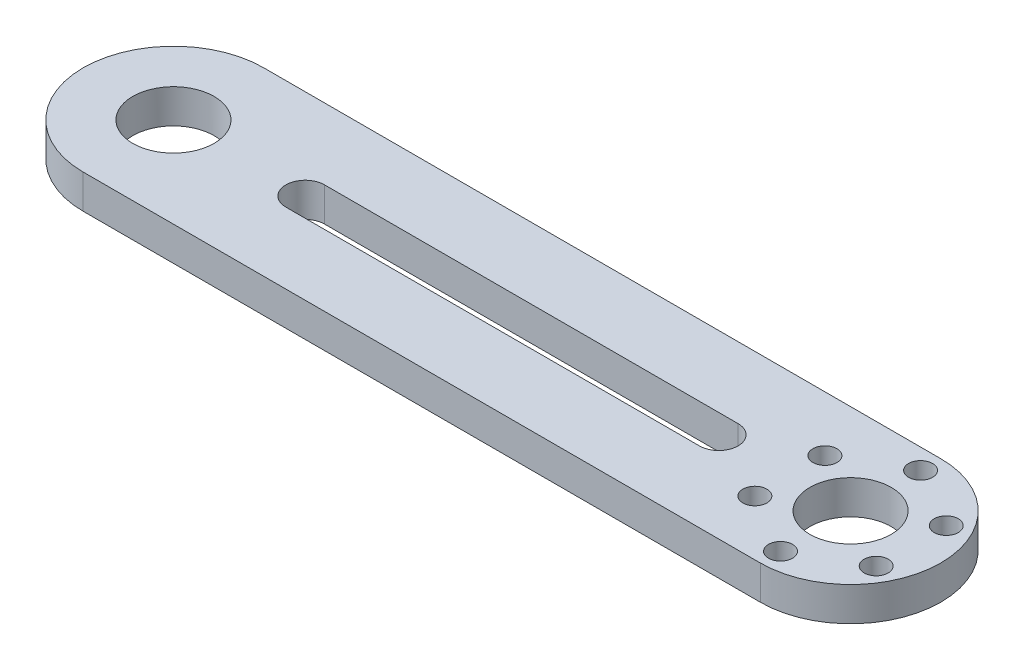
ISO-10303-21;
HEADER;
FILE_DESCRIPTION(('STEP AP214'),'2;1');
FILE_NAME('part.step','',(''),(''),'','','');
FILE_SCHEMA(('AUTOMOTIVE_DESIGN { 1 0 10303 214 1 1 1 1 }'));
ENDSEC;
DATA;
#1=APPLICATION_CONTEXT('core data for automotive mechanical design processes');
#2=APPLICATION_PROTOCOL_DEFINITION('international standard','automotive_design',2000,#1);
#3=PRODUCT_CONTEXT('',#1,'mechanical');
#4=PRODUCT('Part','Part','',(#3));
#5=PRODUCT_RELATED_PRODUCT_CATEGORY('part','',(#4));
#6=PRODUCT_DEFINITION_FORMATION('','',#4);
#7=PRODUCT_DEFINITION_CONTEXT('part definition',#1,'design');
#8=PRODUCT_DEFINITION('design','',#6,#7);
#9=PRODUCT_DEFINITION_SHAPE('','',#8);
#10=(LENGTH_UNIT() NAMED_UNIT(*) SI_UNIT(.MILLI.,.METRE.));
#11=(NAMED_UNIT(*) PLANE_ANGLE_UNIT() SI_UNIT($,.RADIAN.));
#12=(NAMED_UNIT(*) SI_UNIT($,.STERADIAN.) SOLID_ANGLE_UNIT());
#13=UNCERTAINTY_MEASURE_WITH_UNIT(LENGTH_MEASURE(1.E-05),#10,'distance_accuracy_value','');
#14=(GEOMETRIC_REPRESENTATION_CONTEXT(3) GLOBAL_UNCERTAINTY_ASSIGNED_CONTEXT((#13)) GLOBAL_UNIT_ASSIGNED_CONTEXT((#10,
#11,#12)) REPRESENTATION_CONTEXT('',''));
#15=CARTESIAN_POINT('',(0.,0.,0.));
#16=DIRECTION('',(0.,0.,1.));
#17=DIRECTION('',(1.,0.,0.));
#18=AXIS2_PLACEMENT_3D('',#15,#16,#17);
#19=CARTESIAN_POINT('',(51.,5.12,0.));
#20=DIRECTION('',(0.,1.,0.));
#21=DIRECTION('',(0.,0.,1.));
#22=AXIS2_PLACEMENT_3D('',#19,#20,#21);
#23=PLANE('',#22);
#24=CARTESIAN_POINT('',(-51.,5.12,0.));
#25=DIRECTION('',(0.,1.,0.));
#26=DIRECTION('',(0.,0.,-1.));
#27=AXIS2_PLACEMENT_3D('',#24,#25,#26);
#28=CIRCLE('',#27,6.13000000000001);
#29=CARTESIAN_POINT('',(-51.,5.12,-6.13000000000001));
#30=VERTEX_POINT('',#29);
#31=EDGE_CURVE('E383',#30,#30,#28,.T.);
#32=ORIENTED_EDGE('',*,*,#31,.F.);
#33=EDGE_LOOP('',(#32));
#34=FACE_BOUND('',#33,.T.);
#35=CARTESIAN_POINT('',(41.8634319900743,5.12,-5.27499999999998));
#36=DIRECTION('',(0.,1.,0.));
#37=DIRECTION('',(0.,0.,1.));
#38=AXIS2_PLACEMENT_3D('',#35,#36,#37);
#39=CIRCLE('',#38,1.81);
#40=CARTESIAN_POINT('',(41.8634319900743,5.12,-3.46499999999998));
#41=VERTEX_POINT('',#40);
#42=EDGE_CURVE('E393',#41,#41,#39,.T.);
#43=ORIENTED_EDGE('',*,*,#42,.F.);
#44=EDGE_LOOP('',(#43));
#45=FACE_BOUND('',#44,.T.);
#46=CARTESIAN_POINT('',(41.8634319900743,5.12,5.27500000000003));
#47=DIRECTION('',(0.,1.,0.));
#48=DIRECTION('',(0.,0.,1.));
#49=AXIS2_PLACEMENT_3D('',#46,#47,#48);
#50=CIRCLE('',#49,1.80999999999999);
#51=CARTESIAN_POINT('',(41.8634319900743,5.12,7.08500000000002));
#52=VERTEX_POINT('',#51);
#53=EDGE_CURVE('E436',#52,#52,#50,.T.);
#54=ORIENTED_EDGE('',*,*,#53,.F.);
#55=EDGE_LOOP('',(#54));
#56=FACE_BOUND('',#55,.T.);
#57=CARTESIAN_POINT('',(51.0000000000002,5.12,10.55));
#58=DIRECTION('',(0.,1.,0.));
#59=DIRECTION('',(0.,0.,1.));
#60=AXIS2_PLACEMENT_3D('',#57,#58,#59);
#61=CIRCLE('',#60,1.80999999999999);
#62=CARTESIAN_POINT('',(51.0000000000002,5.12,12.36));
#63=VERTEX_POINT('',#62);
#64=EDGE_CURVE('E428',#63,#63,#61,.T.);
#65=ORIENTED_EDGE('',*,*,#64,.F.);
#66=EDGE_LOOP('',(#65));
#67=FACE_BOUND('',#66,.T.);
#68=CARTESIAN_POINT('',(60.136568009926,5.12,5.27499999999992));
#69=DIRECTION('',(0.,1.,0.));
#70=DIRECTION('',(0.,0.,1.));
#71=AXIS2_PLACEMENT_3D('',#68,#69,#70);
#72=CIRCLE('',#71,1.81);
#73=CARTESIAN_POINT('',(60.136568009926,5.12,7.08499999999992));
#74=VERTEX_POINT('',#73);
#75=EDGE_CURVE('E420',#74,#74,#72,.T.);
#76=ORIENTED_EDGE('',*,*,#75,.F.);
#77=EDGE_LOOP('',(#76));
#78=FACE_BOUND('',#77,.T.);
#79=CARTESIAN_POINT('',(60.1365680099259,5.12,-5.27500000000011));
#80=DIRECTION('',(0.,1.,0.));
#81=DIRECTION('',(0.,0.,1.));
#82=AXIS2_PLACEMENT_3D('',#79,#80,#81);
#83=CIRCLE('',#82,1.80999999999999);
#84=CARTESIAN_POINT('',(60.1365680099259,5.12,-3.46500000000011));
#85=VERTEX_POINT('',#84);
#86=EDGE_CURVE('E412',#85,#85,#83,.T.);
#87=ORIENTED_EDGE('',*,*,#86,.F.);
#88=EDGE_LOOP('',(#87));
#89=FACE_BOUND('',#88,.T.);
#90=CARTESIAN_POINT('',(51.,5.12,-10.55));
#91=DIRECTION('',(0.,1.,0.));
#92=DIRECTION('',(0.,0.,1.));
#93=AXIS2_PLACEMENT_3D('',#90,#91,#92);
#94=CIRCLE('',#93,1.81);
#95=CARTESIAN_POINT('',(51.,5.12,-8.74));
#96=VERTEX_POINT('',#95);
#97=EDGE_CURVE('E399',#96,#96,#94,.T.);
#98=ORIENTED_EDGE('',*,*,#97,.F.);
#99=EDGE_LOOP('',(#98));
#100=FACE_BOUND('',#99,.T.);
#101=CARTESIAN_POINT('',(51.,5.12,0.));
#102=DIRECTION('',(0.,1.,0.));
#103=DIRECTION('',(0.,0.,1.));
#104=AXIS2_PLACEMENT_3D('',#101,#102,#103);
#105=CIRCLE('',#104,6.13000000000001);
#106=CARTESIAN_POINT('',(51.,5.12,6.13000000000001));
#107=VERTEX_POINT('',#106);
#108=EDGE_CURVE('E396',#107,#107,#105,.T.);
#109=ORIENTED_EDGE('',*,*,#108,.F.);
#110=EDGE_LOOP('',(#109));
#111=FACE_BOUND('',#110,.T.);
#112=CARTESIAN_POINT('',(51.,5.12,0.));
#113=DIRECTION('',(0.,1.,0.));
#114=DIRECTION('',(0.,0.,1.));
#115=AXIS2_PLACEMENT_3D('',#112,#113,#114);
#116=CIRCLE('',#115,13.6);
#117=CARTESIAN_POINT('',(51.,5.12,13.6));
#118=VERTEX_POINT('',#117);
#119=CARTESIAN_POINT('',(51.,5.12,-13.6));
#120=VERTEX_POINT('',#119);
#121=EDGE_CURVE('E184',#118,#120,#116,.T.);
#122=ORIENTED_EDGE('',*,*,#121,.T.);
#123=DIRECTION('',(-1.,0.,0.));
#124=VECTOR('',#123,1.);
#125=CARTESIAN_POINT('',(51.,5.12,-13.6));
#126=LINE('',#125,#124);
#127=CARTESIAN_POINT('',(-51.,5.12,-13.6));
#128=VERTEX_POINT('',#127);
#129=EDGE_CURVE('E188',#120,#128,#126,.T.);
#130=ORIENTED_EDGE('',*,*,#129,.T.);
#131=CARTESIAN_POINT('',(-51.,5.12,0.));
#132=DIRECTION('',(0.,1.,0.));
#133=DIRECTION('',(0.,0.,1.));
#134=AXIS2_PLACEMENT_3D('',#131,#132,#133);
#135=CIRCLE('',#134,13.6);
#136=CARTESIAN_POINT('',(-51.,5.12,13.6));
#137=VERTEX_POINT('',#136);
#138=EDGE_CURVE('E192',#128,#137,#135,.T.);
#139=ORIENTED_EDGE('',*,*,#138,.T.);
#140=DIRECTION('',(-1.,0.,0.));
#141=VECTOR('',#140,1.);
#142=CARTESIAN_POINT('',(51.,5.12,13.6));
#143=LINE('',#142,#141);
#144=EDGE_CURVE('E195',#118,#137,#143,.T.);
#145=ORIENTED_EDGE('',*,*,#144,.F.);
#146=EDGE_LOOP('',(#122,#130,#139,#145));
#147=FACE_BOUND('',#146,.T.);
#148=DIRECTION('',(-1.,0.,0.));
#149=VECTOR('',#148,1.);
#150=CARTESIAN_POINT('',(31.15,5.12,-2.91000000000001));
#151=LINE('',#150,#149);
#152=CARTESIAN_POINT('',(31.15,5.12,-2.91000000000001));
#153=VERTEX_POINT('',#152);
#154=CARTESIAN_POINT('',(-31.15,5.12,-2.90999999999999));
#155=VERTEX_POINT('',#154);
#156=EDGE_CURVE('E144',#153,#155,#151,.T.);
#157=ORIENTED_EDGE('',*,*,#156,.F.);
#158=CARTESIAN_POINT('',(31.15,5.12,0.));
#159=DIRECTION('',(0.,1.,0.));
#160=DIRECTION('',(0.,0.,1.));
#161=AXIS2_PLACEMENT_3D('',#158,#159,#160);
#162=CIRCLE('',#161,2.91);
#163=CARTESIAN_POINT('',(31.15,5.12,2.90999999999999));
#164=VERTEX_POINT('',#163);
#165=EDGE_CURVE('E135',#164,#153,#162,.T.);
#166=ORIENTED_EDGE('',*,*,#165,.F.);
#167=DIRECTION('',(-1.,0.,0.));
#168=VECTOR('',#167,1.);
#169=CARTESIAN_POINT('',(31.15,5.12,2.90999999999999));
#170=LINE('',#169,#168);
#171=CARTESIAN_POINT('',(-31.15,5.12,2.91000000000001));
#172=VERTEX_POINT('',#171);
#173=EDGE_CURVE('E161',#164,#172,#170,.T.);
#174=ORIENTED_EDGE('',*,*,#173,.T.);
#175=CARTESIAN_POINT('',(-31.15,5.12,0.));
#176=DIRECTION('',(0.,1.,0.));
#177=DIRECTION('',(0.,0.,1.));
#178=AXIS2_PLACEMENT_3D('',#175,#176,#177);
#179=CIRCLE('',#178,2.91);
#180=EDGE_CURVE('E157',#155,#172,#179,.T.);
#181=ORIENTED_EDGE('',*,*,#180,.F.);
#182=EDGE_LOOP('',(#157,#166,#174,#181));
#183=FACE_BOUND('',#182,.T.);
#184=ADVANCED_FACE('F69',(#34,#45,#56,#67,#78,#89,#100,#111,#147,#183),#23,.T.);
#185=CARTESIAN_POINT('',(51.,0.,0.));
#186=DIRECTION('',(0.,1.,0.));
#187=DIRECTION('',(0.,0.,1.));
#188=AXIS2_PLACEMENT_3D('',#185,#186,#187);
#189=PLANE('',#188);
#190=CARTESIAN_POINT('',(-51.,0.,0.));
#191=DIRECTION('',(0.,1.,0.));
#192=DIRECTION('',(0.,0.,1.));
#193=AXIS2_PLACEMENT_3D('',#190,#191,#192);
#194=CIRCLE('',#193,6.13000000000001);
#195=CARTESIAN_POINT('',(-51.,0.,6.13000000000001));
#196=VERTEX_POINT('',#195);
#197=EDGE_CURVE('E386',#196,#196,#194,.F.);
#198=ORIENTED_EDGE('',*,*,#197,.F.);
#199=EDGE_LOOP('',(#198));
#200=FACE_BOUND('',#199,.T.);
#201=CARTESIAN_POINT('',(41.8634319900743,0.,-5.27499999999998));
#202=DIRECTION('',(0.,1.,0.));
#203=DIRECTION('',(0.,0.,1.));
#204=AXIS2_PLACEMENT_3D('',#201,#202,#203);
#205=CIRCLE('',#204,1.81);
#206=CARTESIAN_POINT('',(41.8634319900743,0.,-3.46499999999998));
#207=VERTEX_POINT('',#206);
#208=EDGE_CURVE('E390',#207,#207,#205,.F.);
#209=ORIENTED_EDGE('',*,*,#208,.F.);
#210=EDGE_LOOP('',(#209));
#211=FACE_BOUND('',#210,.T.);
#212=CARTESIAN_POINT('',(41.8634319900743,0.,5.27500000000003));
#213=DIRECTION('',(0.,1.,0.));
#214=DIRECTION('',(0.,0.,1.));
#215=AXIS2_PLACEMENT_3D('',#212,#213,#214);
#216=CIRCLE('',#215,1.80999999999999);
#217=CARTESIAN_POINT('',(41.8634319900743,0.,7.08500000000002));
#218=VERTEX_POINT('',#217);
#219=EDGE_CURVE('E440',#218,#218,#216,.F.);
#220=ORIENTED_EDGE('',*,*,#219,.F.);
#221=EDGE_LOOP('',(#220));
#222=FACE_BOUND('',#221,.T.);
#223=CARTESIAN_POINT('',(51.0000000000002,0.,10.55));
#224=DIRECTION('',(0.,1.,0.));
#225=DIRECTION('',(0.,0.,1.));
#226=AXIS2_PLACEMENT_3D('',#223,#224,#225);
#227=CIRCLE('',#226,1.80999999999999);
#228=CARTESIAN_POINT('',(51.0000000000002,0.,12.36));
#229=VERTEX_POINT('',#228);
#230=EDGE_CURVE('E432',#229,#229,#227,.F.);
#231=ORIENTED_EDGE('',*,*,#230,.F.);
#232=EDGE_LOOP('',(#231));
#233=FACE_BOUND('',#232,.T.);
#234=CARTESIAN_POINT('',(60.136568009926,0.,5.27499999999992));
#235=DIRECTION('',(0.,1.,0.));
#236=DIRECTION('',(0.,0.,1.));
#237=AXIS2_PLACEMENT_3D('',#234,#235,#236);
#238=CIRCLE('',#237,1.81);
#239=CARTESIAN_POINT('',(60.136568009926,0.,7.08499999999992));
#240=VERTEX_POINT('',#239);
#241=EDGE_CURVE('E424',#240,#240,#238,.F.);
#242=ORIENTED_EDGE('',*,*,#241,.F.);
#243=EDGE_LOOP('',(#242));
#244=FACE_BOUND('',#243,.T.);
#245=CARTESIAN_POINT('',(60.1365680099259,0.,-5.27500000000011));
#246=DIRECTION('',(0.,1.,0.));
#247=DIRECTION('',(0.,0.,1.));
#248=AXIS2_PLACEMENT_3D('',#245,#246,#247);
#249=CIRCLE('',#248,1.80999999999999);
#250=CARTESIAN_POINT('',(60.1365680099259,0.,-3.46500000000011));
#251=VERTEX_POINT('',#250);
#252=EDGE_CURVE('E416',#251,#251,#249,.F.);
#253=ORIENTED_EDGE('',*,*,#252,.F.);
#254=EDGE_LOOP('',(#253));
#255=FACE_BOUND('',#254,.T.);
#256=CARTESIAN_POINT('',(51.,0.,-10.55));
#257=DIRECTION('',(0.,1.,0.));
#258=DIRECTION('',(0.,0.,1.));
#259=AXIS2_PLACEMENT_3D('',#256,#257,#258);
#260=CIRCLE('',#259,1.81);
#261=CARTESIAN_POINT('',(51.,0.,-8.74));
#262=VERTEX_POINT('',#261);
#263=EDGE_CURVE('E408',#262,#262,#260,.F.);
#264=ORIENTED_EDGE('',*,*,#263,.F.);
#265=EDGE_LOOP('',(#264));
#266=FACE_BOUND('',#265,.T.);
#267=CARTESIAN_POINT('',(51.,0.,0.));
#268=DIRECTION('',(0.,1.,0.));
#269=DIRECTION('',(0.,0.,1.));
#270=AXIS2_PLACEMENT_3D('',#267,#268,#269);
#271=CIRCLE('',#270,6.13000000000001);
#272=CARTESIAN_POINT('',(51.,0.,6.13000000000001));
#273=VERTEX_POINT('',#272);
#274=EDGE_CURVE('E169',#273,#273,#271,.F.);
#275=ORIENTED_EDGE('',*,*,#274,.F.);
#276=EDGE_LOOP('',(#275));
#277=FACE_BOUND('',#276,.T.);
#278=CARTESIAN_POINT('',(51.,0.,0.));
#279=DIRECTION('',(0.,1.,0.));
#280=DIRECTION('',(0.,0.,1.));
#281=AXIS2_PLACEMENT_3D('',#278,#279,#280);
#282=CIRCLE('',#281,13.6);
#283=CARTESIAN_POINT('',(51.,0.,13.6));
#284=VERTEX_POINT('',#283);
#285=CARTESIAN_POINT('',(51.,0.,-13.6));
#286=VERTEX_POINT('',#285);
#287=EDGE_CURVE('E153',#284,#286,#282,.T.);
#288=ORIENTED_EDGE('',*,*,#287,.F.);
#289=DIRECTION('',(-1.,0.,0.));
#290=VECTOR('',#289,1.);
#291=CARTESIAN_POINT('',(51.,0.,13.6));
#292=LINE('',#291,#290);
#293=CARTESIAN_POINT('',(-51.,0.,13.6));
#294=VERTEX_POINT('',#293);
#295=EDGE_CURVE('E189',#284,#294,#292,.T.);
#296=ORIENTED_EDGE('',*,*,#295,.T.);
#297=CARTESIAN_POINT('',(-51.,0.,0.));
#298=DIRECTION('',(0.,1.,0.));
#299=DIRECTION('',(0.,0.,1.));
#300=AXIS2_PLACEMENT_3D('',#297,#298,#299);
#301=CIRCLE('',#300,13.6);
#302=CARTESIAN_POINT('',(-51.,0.,-13.6));
#303=VERTEX_POINT('',#302);
#304=EDGE_CURVE('E206',#303,#294,#301,.T.);
#305=ORIENTED_EDGE('',*,*,#304,.F.);
#306=DIRECTION('',(-1.,0.,0.));
#307=VECTOR('',#306,1.);
#308=CARTESIAN_POINT('',(51.,0.,-13.6));
#309=LINE('',#308,#307);
#310=EDGE_CURVE('E203',#286,#303,#309,.T.);
#311=ORIENTED_EDGE('',*,*,#310,.F.);
#312=EDGE_LOOP('',(#288,#296,#305,#311));
#313=FACE_BOUND('',#312,.T.);
#314=CARTESIAN_POINT('',(31.15,0.,0.));
#315=DIRECTION('',(0.,1.,0.));
#316=DIRECTION('',(0.,0.,1.));
#317=AXIS2_PLACEMENT_3D('',#314,#315,#316);
#318=CIRCLE('',#317,2.91);
#319=CARTESIAN_POINT('',(31.15,0.,2.90999999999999));
#320=VERTEX_POINT('',#319);
#321=CARTESIAN_POINT('',(31.15,0.,-2.91000000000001));
#322=VERTEX_POINT('',#321);
#323=EDGE_CURVE('E93',#320,#322,#318,.T.);
#324=ORIENTED_EDGE('',*,*,#323,.T.);
#325=DIRECTION('',(-1.,0.,0.));
#326=VECTOR('',#325,1.);
#327=CARTESIAN_POINT('',(31.15,0.,-2.91000000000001));
#328=LINE('',#327,#326);
#329=CARTESIAN_POINT('',(-31.15,0.,-2.90999999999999));
#330=VERTEX_POINT('',#329);
#331=EDGE_CURVE('E151',#322,#330,#328,.T.);
#332=ORIENTED_EDGE('',*,*,#331,.T.);
#333=CARTESIAN_POINT('',(-31.15,0.,0.));
#334=DIRECTION('',(0.,1.,0.));
#335=DIRECTION('',(0.,0.,1.));
#336=AXIS2_PLACEMENT_3D('',#333,#334,#335);
#337=CIRCLE('',#336,2.91);
#338=CARTESIAN_POINT('',(-31.15,0.,2.91));
#339=VERTEX_POINT('',#338);
#340=EDGE_CURVE('E172',#330,#339,#337,.T.);
#341=ORIENTED_EDGE('',*,*,#340,.T.);
#342=DIRECTION('',(-1.,0.,0.));
#343=VECTOR('',#342,1.);
#344=CARTESIAN_POINT('',(31.15,0.,2.90999999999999));
#345=LINE('',#344,#343);
#346=EDGE_CURVE('E145',#320,#339,#345,.T.);
#347=ORIENTED_EDGE('',*,*,#346,.F.);
#348=EDGE_LOOP('',(#324,#332,#341,#347));
#349=FACE_BOUND('',#348,.T.);
#350=ADVANCED_FACE('F228',(#200,#211,#222,#233,#244,#255,#266,#277,#313,#349),#189,.F.);
#351=CARTESIAN_POINT('',(51.,5.12,0.));
#352=DIRECTION('',(0.,-1.,0.));
#353=DIRECTION('',(0.,0.,-1.));
#354=AXIS2_PLACEMENT_3D('',#351,#352,#353);
#355=CYLINDRICAL_SURFACE('',#354,13.6);
#356=ORIENTED_EDGE('',*,*,#287,.T.);
#357=DIRECTION('',(0.,-1.,0.));
#358=VECTOR('',#357,1.);
#359=CARTESIAN_POINT('',(51.,5.12,-13.6));
#360=LINE('',#359,#358);
#361=EDGE_CURVE('E12',#120,#286,#360,.T.);
#362=ORIENTED_EDGE('',*,*,#361,.F.);
#363=ORIENTED_EDGE('',*,*,#121,.F.);
#364=DIRECTION('',(0.,-1.,0.));
#365=VECTOR('',#364,1.);
#366=CARTESIAN_POINT('',(51.,5.12,13.6));
#367=LINE('',#366,#365);
#368=EDGE_CURVE('E199',#118,#284,#367,.T.);
#369=ORIENTED_EDGE('',*,*,#368,.T.);
#370=EDGE_LOOP('',(#356,#362,#363,#369));
#371=FACE_BOUND('',#370,.T.);
#372=ADVANCED_FACE('F71',(#371),#355,.T.);
#373=CARTESIAN_POINT('',(51.,5.12,-13.6));
#374=DIRECTION('',(0.,0.,1.));
#375=DIRECTION('',(1.,0.,0.));
#376=AXIS2_PLACEMENT_3D('',#373,#374,#375);
#377=PLANE('',#376);
#378=ORIENTED_EDGE('',*,*,#310,.T.);
#379=DIRECTION('',(0.,-1.,0.));
#380=VECTOR('',#379,1.);
#381=CARTESIAN_POINT('',(-51.,5.12,-13.6));
#382=LINE('',#381,#380);
#383=EDGE_CURVE('E78',#128,#303,#382,.T.);
#384=ORIENTED_EDGE('',*,*,#383,.F.);
#385=ORIENTED_EDGE('',*,*,#129,.F.);
#386=ORIENTED_EDGE('',*,*,#361,.T.);
#387=EDGE_LOOP('',(#378,#384,#385,#386));
#388=FACE_BOUND('',#387,.T.);
#389=ADVANCED_FACE('F237',(#388),#377,.F.);
#390=CARTESIAN_POINT('',(-51.,5.12,0.));
#391=DIRECTION('',(0.,-1.,0.));
#392=DIRECTION('',(0.,0.,-1.));
#393=AXIS2_PLACEMENT_3D('',#390,#391,#392);
#394=CYLINDRICAL_SURFACE('',#393,13.6);
#395=ORIENTED_EDGE('',*,*,#304,.T.);
#396=DIRECTION('',(0.,-1.,0.));
#397=VECTOR('',#396,1.);
#398=CARTESIAN_POINT('',(-51.,5.12,13.6));
#399=LINE('',#398,#397);
#400=EDGE_CURVE('E215',#137,#294,#399,.T.);
#401=ORIENTED_EDGE('',*,*,#400,.F.);
#402=ORIENTED_EDGE('',*,*,#138,.F.);
#403=ORIENTED_EDGE('',*,*,#383,.T.);
#404=EDGE_LOOP('',(#395,#401,#402,#403));
#405=FACE_BOUND('',#404,.T.);
#406=ADVANCED_FACE('F223',(#405),#394,.T.);
#407=CARTESIAN_POINT('',(51.,5.12,13.6));
#408=DIRECTION('',(0.,0.,1.));
#409=DIRECTION('',(1.,0.,0.));
#410=AXIS2_PLACEMENT_3D('',#407,#408,#409);
#411=PLANE('',#410);
#412=ORIENTED_EDGE('',*,*,#295,.F.);
#413=ORIENTED_EDGE('',*,*,#368,.F.);
#414=ORIENTED_EDGE('',*,*,#144,.T.);
#415=ORIENTED_EDGE('',*,*,#400,.T.);
#416=EDGE_LOOP('',(#412,#413,#414,#415));
#417=FACE_BOUND('',#416,.T.);
#418=ADVANCED_FACE('F232',(#417),#411,.T.);
#419=CARTESIAN_POINT('',(31.15,5.12,0.));
#420=DIRECTION('',(0.,-1.,0.));
#421=DIRECTION('',(0.,0.,-1.));
#422=AXIS2_PLACEMENT_3D('',#419,#420,#421);
#423=CYLINDRICAL_SURFACE('',#422,2.91);
#424=ORIENTED_EDGE('',*,*,#323,.F.);
#425=DIRECTION('',(0.,-1.,0.));
#426=VECTOR('',#425,1.);
#427=CARTESIAN_POINT('',(31.15,5.12,2.90999999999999));
#428=LINE('',#427,#426);
#429=EDGE_CURVE('E139',#164,#320,#428,.T.);
#430=ORIENTED_EDGE('',*,*,#429,.F.);
#431=ORIENTED_EDGE('',*,*,#165,.T.);
#432=DIRECTION('',(0.,-1.,0.));
#433=VECTOR('',#432,1.);
#434=CARTESIAN_POINT('',(31.15,5.12,-2.91000000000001));
#435=LINE('',#434,#433);
#436=EDGE_CURVE('E138',#153,#322,#435,.T.);
#437=ORIENTED_EDGE('',*,*,#436,.T.);
#438=EDGE_LOOP('',(#424,#430,#431,#437));
#439=FACE_BOUND('',#438,.T.);
#440=ADVANCED_FACE('F137',(#439),#423,.F.);
#441=CARTESIAN_POINT('',(31.15,5.12,-2.91000000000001));
#442=DIRECTION('',(0.,0.,1.));
#443=DIRECTION('',(1.,0.,0.));
#444=AXIS2_PLACEMENT_3D('',#441,#442,#443);
#445=PLANE('',#444);
#446=ORIENTED_EDGE('',*,*,#331,.F.);
#447=ORIENTED_EDGE('',*,*,#436,.F.);
#448=ORIENTED_EDGE('',*,*,#156,.T.);
#449=DIRECTION('',(0.,-1.,0.));
#450=VECTOR('',#449,1.);
#451=CARTESIAN_POINT('',(-31.15,5.12,-2.90999999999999));
#452=LINE('',#451,#450);
#453=EDGE_CURVE('E154',#155,#330,#452,.T.);
#454=ORIENTED_EDGE('',*,*,#453,.T.);
#455=EDGE_LOOP('',(#446,#447,#448,#454));
#456=FACE_BOUND('',#455,.T.);
#457=ADVANCED_FACE('F148',(#456),#445,.T.);
#458=CARTESIAN_POINT('',(-31.15,5.12,0.));
#459=DIRECTION('',(0.,-1.,0.));
#460=DIRECTION('',(0.,0.,-1.));
#461=AXIS2_PLACEMENT_3D('',#458,#459,#460);
#462=CYLINDRICAL_SURFACE('',#461,2.91);
#463=ORIENTED_EDGE('',*,*,#340,.F.);
#464=ORIENTED_EDGE('',*,*,#453,.F.);
#465=ORIENTED_EDGE('',*,*,#180,.T.);
#466=DIRECTION('',(0.,-1.,0.));
#467=VECTOR('',#466,1.);
#468=CARTESIAN_POINT('',(-31.15,5.12,2.91));
#469=LINE('',#468,#467);
#470=EDGE_CURVE('E85',#172,#339,#469,.T.);
#471=ORIENTED_EDGE('',*,*,#470,.T.);
#472=EDGE_LOOP('',(#463,#464,#465,#471));
#473=FACE_BOUND('',#472,.T.);
#474=ADVANCED_FACE('F282',(#473),#462,.F.);
#475=CARTESIAN_POINT('',(31.15,5.12,2.90999999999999));
#476=DIRECTION('',(0.,0.,1.));
#477=DIRECTION('',(1.,0.,0.));
#478=AXIS2_PLACEMENT_3D('',#475,#476,#477);
#479=PLANE('',#478);
#480=ORIENTED_EDGE('',*,*,#346,.T.);
#481=ORIENTED_EDGE('',*,*,#470,.F.);
#482=ORIENTED_EDGE('',*,*,#173,.F.);
#483=ORIENTED_EDGE('',*,*,#429,.T.);
#484=EDGE_LOOP('',(#480,#481,#482,#483));
#485=FACE_BOUND('',#484,.T.);
#486=ADVANCED_FACE('F288',(#485),#479,.F.);
#487=CARTESIAN_POINT('',(51.,-0.00100000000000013,0.));
#488=DIRECTION('',(0.,1.,0.));
#489=DIRECTION('',(0.,0.,1.));
#490=AXIS2_PLACEMENT_3D('',#487,#488,#489);
#491=CYLINDRICAL_SURFACE('',#490,6.13000000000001);
#492=ORIENTED_EDGE('',*,*,#108,.T.);
#493=EDGE_LOOP('',(#492));
#494=FACE_BOUND('',#493,.T.);
#495=ORIENTED_EDGE('',*,*,#274,.T.);
#496=EDGE_LOOP('',(#495));
#497=FACE_BOUND('',#496,.T.);
#498=ADVANCED_FACE('F296',(#494,#497),#491,.F.);
#499=CARTESIAN_POINT('',(51.,-0.00100000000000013,-10.55));
#500=DIRECTION('',(0.,1.,0.));
#501=DIRECTION('',(0.,0.,1.));
#502=AXIS2_PLACEMENT_3D('',#499,#500,#501);
#503=CYLINDRICAL_SURFACE('',#502,1.81);
#504=ORIENTED_EDGE('',*,*,#97,.T.);
#505=EDGE_LOOP('',(#504));
#506=FACE_BOUND('',#505,.T.);
#507=ORIENTED_EDGE('',*,*,#263,.T.);
#508=EDGE_LOOP('',(#507));
#509=FACE_BOUND('',#508,.T.);
#510=ADVANCED_FACE('F308',(#506,#509),#503,.F.);
#511=CARTESIAN_POINT('',(60.1365680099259,-0.00100000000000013,-5.27500000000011));
#512=DIRECTION('',(0.,1.,0.));
#513=DIRECTION('',(0.,0.,1.));
#514=AXIS2_PLACEMENT_3D('',#511,#512,#513);
#515=CYLINDRICAL_SURFACE('',#514,1.80999999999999);
#516=ORIENTED_EDGE('',*,*,#86,.T.);
#517=EDGE_LOOP('',(#516));
#518=FACE_BOUND('',#517,.T.);
#519=ORIENTED_EDGE('',*,*,#252,.T.);
#520=EDGE_LOOP('',(#519));
#521=FACE_BOUND('',#520,.T.);
#522=ADVANCED_FACE('F318',(#518,#521),#515,.F.);
#523=CARTESIAN_POINT('',(60.136568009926,-0.00100000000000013,5.27499999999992));
#524=DIRECTION('',(0.,1.,0.));
#525=DIRECTION('',(0.,0.,1.));
#526=AXIS2_PLACEMENT_3D('',#523,#524,#525);
#527=CYLINDRICAL_SURFACE('',#526,1.81);
#528=ORIENTED_EDGE('',*,*,#75,.T.);
#529=EDGE_LOOP('',(#528));
#530=FACE_BOUND('',#529,.T.);
#531=ORIENTED_EDGE('',*,*,#241,.T.);
#532=EDGE_LOOP('',(#531));
#533=FACE_BOUND('',#532,.T.);
#534=ADVANCED_FACE('F328',(#530,#533),#527,.F.);
#535=CARTESIAN_POINT('',(51.0000000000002,-0.00100000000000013,10.55));
#536=DIRECTION('',(0.,1.,0.));
#537=DIRECTION('',(0.,0.,1.));
#538=AXIS2_PLACEMENT_3D('',#535,#536,#537);
#539=CYLINDRICAL_SURFACE('',#538,1.80999999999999);
#540=ORIENTED_EDGE('',*,*,#64,.T.);
#541=EDGE_LOOP('',(#540));
#542=FACE_BOUND('',#541,.T.);
#543=ORIENTED_EDGE('',*,*,#230,.T.);
#544=EDGE_LOOP('',(#543));
#545=FACE_BOUND('',#544,.T.);
#546=ADVANCED_FACE('F338',(#542,#545),#539,.F.);
#547=CARTESIAN_POINT('',(41.8634319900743,-0.00100000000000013,5.27500000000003));
#548=DIRECTION('',(0.,1.,0.));
#549=DIRECTION('',(0.,0.,1.));
#550=AXIS2_PLACEMENT_3D('',#547,#548,#549);
#551=CYLINDRICAL_SURFACE('',#550,1.80999999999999);
#552=ORIENTED_EDGE('',*,*,#53,.T.);
#553=EDGE_LOOP('',(#552));
#554=FACE_BOUND('',#553,.T.);
#555=ORIENTED_EDGE('',*,*,#219,.T.);
#556=EDGE_LOOP('',(#555));
#557=FACE_BOUND('',#556,.T.);
#558=ADVANCED_FACE('F348',(#554,#557),#551,.F.);
#559=CARTESIAN_POINT('',(41.8634319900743,-0.00100000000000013,-5.27499999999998));
#560=DIRECTION('',(0.,1.,0.));
#561=DIRECTION('',(0.,0.,1.));
#562=AXIS2_PLACEMENT_3D('',#559,#560,#561);
#563=CYLINDRICAL_SURFACE('',#562,1.81);
#564=ORIENTED_EDGE('',*,*,#42,.T.);
#565=EDGE_LOOP('',(#564));
#566=FACE_BOUND('',#565,.T.);
#567=ORIENTED_EDGE('',*,*,#208,.T.);
#568=EDGE_LOOP('',(#567));
#569=FACE_BOUND('',#568,.T.);
#570=ADVANCED_FACE('F358',(#566,#569),#563,.F.);
#571=CARTESIAN_POINT('',(-51.,-0.00100000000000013,0.));
#572=DIRECTION('',(0.,1.,0.));
#573=DIRECTION('',(0.,0.,1.));
#574=AXIS2_PLACEMENT_3D('',#571,#572,#573);
#575=CYLINDRICAL_SURFACE('',#574,6.13000000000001);
#576=ORIENTED_EDGE('',*,*,#31,.T.);
#577=EDGE_LOOP('',(#576));
#578=FACE_BOUND('',#577,.T.);
#579=ORIENTED_EDGE('',*,*,#197,.T.);
#580=EDGE_LOOP('',(#579));
#581=FACE_BOUND('',#580,.T.);
#582=ADVANCED_FACE('F368',(#578,#581),#575,.F.);
#583=CLOSED_SHELL('',(#184,#350,#372,#389,#406,#418,#440,#457,#474,#486,#498,#510,#522,#534,
#546,#558,#570,#582));
#584=MANIFOLD_SOLID_BREP('B2',#583);
#585=ADVANCED_BREP_SHAPE_REPRESENTATION('',(#18,#584),#14);
#586=SHAPE_DEFINITION_REPRESENTATION(#9,#585);
ENDSEC;
END-ISO-10303-21;
